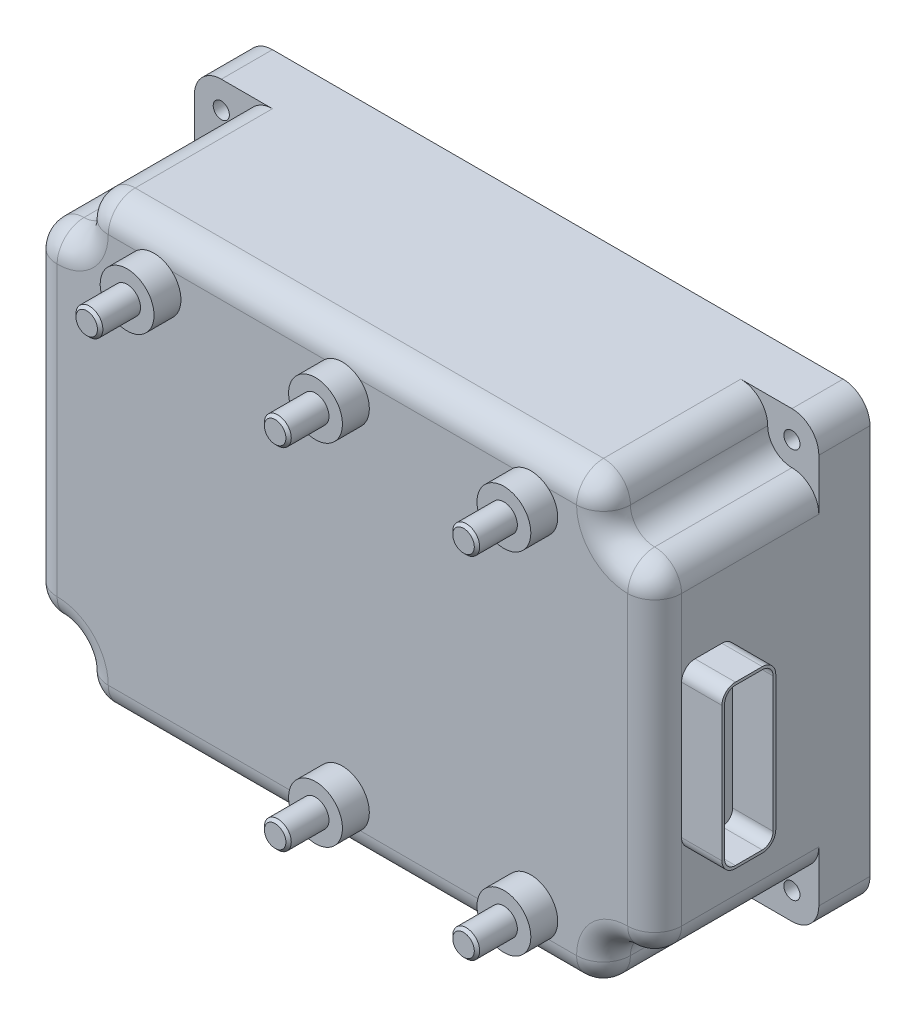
from build123d import *

# Parameters (mm, degrees)
ESQUISSE1_R        = 3
EXTRUSION1_DEPTH   = 19
EXTRUSION2_DEPTH   = 61
CONG_1_R           = 10
ESQUISSE3_R        = 10
EXTRUSION3_DEPTH   = 10
ESQUISSE4_R        = 5
EXTRUSION4_DEPTH   = 15
CHANFREIN1_SIZE    = 1
EXTRU_MINCE1_DEPTH = 15


with BuildPart() as part:
    # Esquisse1 → Extrusion1 (new body)
    with BuildSketch(Plane.XY):
        with BuildLine():
            Line((-106, 82.5), (106, 82.5))
            ThreePointArc((106, 82.5), (113.071067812, 79.571067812), (116, 72.5))
            Line((116, 72.5), (116, -72.5))
            ThreePointArc((116, -72.5), (113.071067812, -79.571067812), (106, -82.5))
            Line((106, -82.5), (-106, -82.5))
            ThreePointArc((-106, -82.5), (-113.071067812, -79.571067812), (-116, -72.5))
            Line((-116, -72.5), (-116, 72.5))
            ThreePointArc((-116, 72.5), (-113.071067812, 79.571067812), (-106, 82.5))
        make_face()
        with Locations((-106, 72.5)):
            Circle(ESQUISSE1_R, mode=Mode.SUBTRACT)
        with Locations((-106, -72.5)):
            Circle(ESQUISSE1_R, mode=Mode.SUBTRACT)
        with Locations((106, -72.5)):
            Circle(ESQUISSE1_R, mode=Mode.SUBTRACT)
        with Locations((106, 72.5)):
            Circle(ESQUISSE1_R, mode=Mode.SUBTRACT)
    extrude(amount=EXTRUSION1_DEPTH)

    # Esquisse2 → Extrusion2 (add)
    with BuildSketch(Plane.XY.offset(19)):
        with BuildLine():
            Line((-87, 82.5), (87, 82.5))
            ThreePointArc((87, 82.5), (94.071067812, 79.571067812), (97, 72.5))
            ThreePointArc((97, 72.5), (99.636038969, 66.136038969), (106, 63.5))
            ThreePointArc((106, 63.5), (113.071067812, 60.571067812), (116, 53.5))
            Line((116, 53.5), (116, -53.5))
            ThreePointArc((116, -53.5), (113.071067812, -60.571067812), (106, -63.5))
            ThreePointArc((106, -63.5), (99.636038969, -66.136038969), (97, -72.5))
            ThreePointArc((97, -72.5), (94.071067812, -79.571067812), (87, -82.5))
            Line((87, -82.5), (-87, -82.5))
            ThreePointArc((-87, -82.5), (-94.071067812, -79.571067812), (-97, -72.5))
            ThreePointArc((-97, -72.5), (-99.636038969, -66.136038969), (-106, -63.5))
            ThreePointArc((-106, -63.5), (-113.071067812, -60.571067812), (-116, -53.5))
            Line((-116, -53.5), (-116, 53.5))
            ThreePointArc((-116, 53.5), (-113.071067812, 60.571067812), (-106, 63.5))
            ThreePointArc((-106, 63.5), (-99.636038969, 66.136038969), (-97, 72.5))
            ThreePointArc((-97, 72.5), (-94.071067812, 79.571067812), (-87, 82.5))
        make_face()
    extrude(amount=EXTRUSION2_DEPTH)

    # Cong_1
    cong_1_edges = [part.edges().sort_by_distance(p)[0] for p in [
        (0, 82.5, 80),
        (-116, 0, 80),
        (116, 0, 80),
        (0, -82.5, 80),
        (-113.071067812, 60.571067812, 80),
        (-99.636038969, 66.136038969, 80),
        (-94.071067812, 79.571067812, 80),
        (94.071067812, 79.571067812, 80),
        (-99.636038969, -66.136038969, 80),
        (-113.071067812, -60.571067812, 80),
        (99.636038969, 66.136038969, 80),
        (113.071067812, 60.571067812, 80),
        (113.071067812, -60.571067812, 80),
        (99.636038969, -66.136038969, 80),
        (94.071067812, -79.571067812, 80),
        (-94.071067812, -79.571067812, 80),
    ]]
    fillet(cong_1_edges, radius=CONG_1_R)

    # Esquisse3 → Extrusion3 (add)
    with BuildSketch(Plane.XY.offset(80)):
        with Locations(Location((-70, 65, 0), (0, 0, 131.409622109))):
            Circle(ESQUISSE3_R)
        with Locations(Location((0, 65, 0), (0, 0, 131.409622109))):
            Circle(ESQUISSE3_R)
        with Locations(Location((70, 65, 0), (0, 0, 131.409622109))):
            Circle(ESQUISSE3_R)
        with Locations(Location((70, -65, 0), (0, 0, 228.590377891))):
            Circle(ESQUISSE3_R)
        with Locations(Location((0, -65, 0), (0, 0, 228.590377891))):
            Circle(ESQUISSE3_R)
    extrude(amount=EXTRUSION3_DEPTH)

    # Esquisse4 → Extrusion4 (add)
    with BuildSketch(Plane.XY.offset(90)):
        with Locations((-70, 65)):
            Circle(ESQUISSE4_R)
        with Locations((0, 65)):
            Circle(ESQUISSE4_R)
        with Locations((70, 65)):
            Circle(ESQUISSE4_R)
        with Locations((70, -65)):
            Circle(ESQUISSE4_R)
        with Locations((0, -65)):
            Circle(ESQUISSE4_R)
    extrude(amount=EXTRUSION4_DEPTH)

    # Chanfrein1
    chanfrein1_edges = [part.edges().sort_by_distance(p)[0] for p in [
        (-5, -65, 105),
        (65, -65, 105),
        (65, 65, 105),
        (-5, 65, 105),
        (-75, 65, 105),
    ]]
    chamfer(chanfrein1_edges, length=CHANFREIN1_SIZE)

    # Esquisse5 → Extru.-Mince1 (add)
    with BuildSketch(Plane(origin=(116, 0, 0), x_dir=(0, 0, -1), z_dir=(1, 0, 0))):
        with BuildLine():
            Line((-70, 25), (-70, -25))
            ThreePointArc((-70, -25), (-68.535533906, -28.535533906), (-65, -30))
            Line((-65, -30), (-55, -30))
            ThreePointArc((-55, -30), (-51.464466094, -28.535533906), (-50, -25))
            Line((-50, -25), (-50, 25))
            ThreePointArc((-50, 25), (-51.464466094, 28.535533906), (-55, 30))
            Line((-55, 30), (-65, 30))
            ThreePointArc((-65, 30), (-68.535533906, 28.535533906), (-70, 25))
        make_face()
        with BuildLine():
            Line((-69, 25), (-69, -25))
            ThreePointArc((-69, -25), (-67.828427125, -27.828427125), (-65, -29))
            Line((-65, -29), (-55, -29))
            ThreePointArc((-55, -29), (-52.171572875, -27.828427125), (-51, -25))
            Line((-51, -25), (-51, 25))
            ThreePointArc((-51, 25), (-52.171572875, 27.828427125), (-55, 29))
            Line((-55, 29), (-65, 29))
            ThreePointArc((-65, 29), (-67.828427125, 27.828427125), (-69, 25))
        make_face(mode=Mode.SUBTRACT)
    extrude(amount=EXTRU_MINCE1_DEPTH)


solid = part.part
